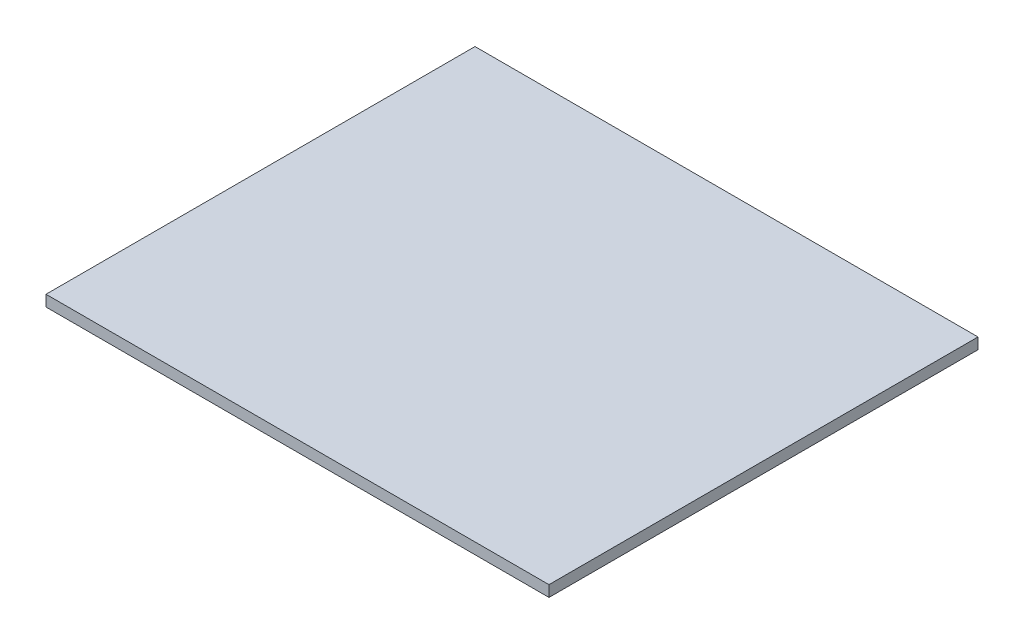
from build123d import *

# Parameters (mm, degrees)
SKETCH1_W           = 215.9
SKETCH1_H           = 184.15
BOSS_EXTRUDE1_DEPTH = 4.7625


with BuildPart() as part:
    # Sketch1 → Boss-Extrude1 (new body)
    with BuildSketch(Plane(origin=(0, 0, 0), x_dir=(1, 0, 0), z_dir=(0, 1, 0))):
        Rectangle(SKETCH1_W, SKETCH1_H)
    extrude(amount=BOSS_EXTRUDE1_DEPTH)


solid = part.part
